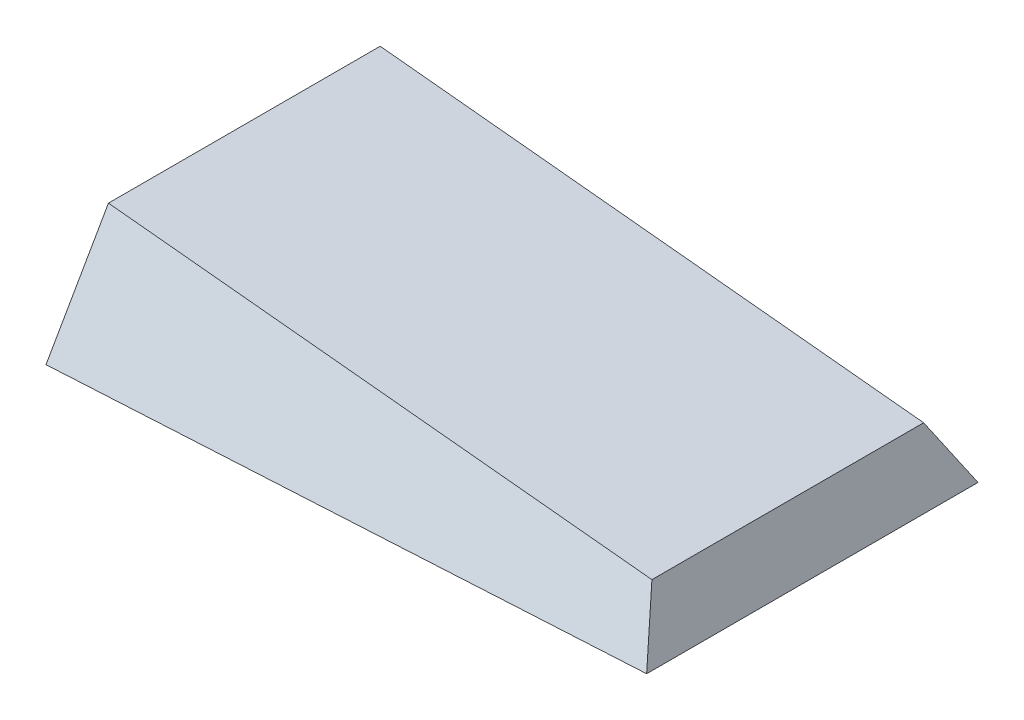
from build123d import *

# Parameters (mm, degrees)
EXTRUDE1_DEPTH = 25
DRAFT1_ANGLE   = 30


with BuildPart() as part:
    # Sketch1 → Extrude1 (new, symmetric)
    with BuildSketch(Plane.XY):
        Polygon((0, 0), (-100, 0), (-100, 20), (0, 10), align=None)
    extrude(amount=EXTRUDE1_DEPTH, both=True)

    # Draft1
    draft1_faces = [part.faces().sort_by_distance(p)[0] for p in [
        (0, 5, 0),
        (-55.555555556, 7.777777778, -25),
        (-55.555555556, 7.777777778, 25),
    ]]
    draft(draft1_faces, Plane(origin=(-100, 20, 25), x_dir=(0.9950371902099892, -0.09950371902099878, 0), z_dir=(0.09950371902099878, 0.9950371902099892, 0)), DRAFT1_ANGLE)


solid = part.part
